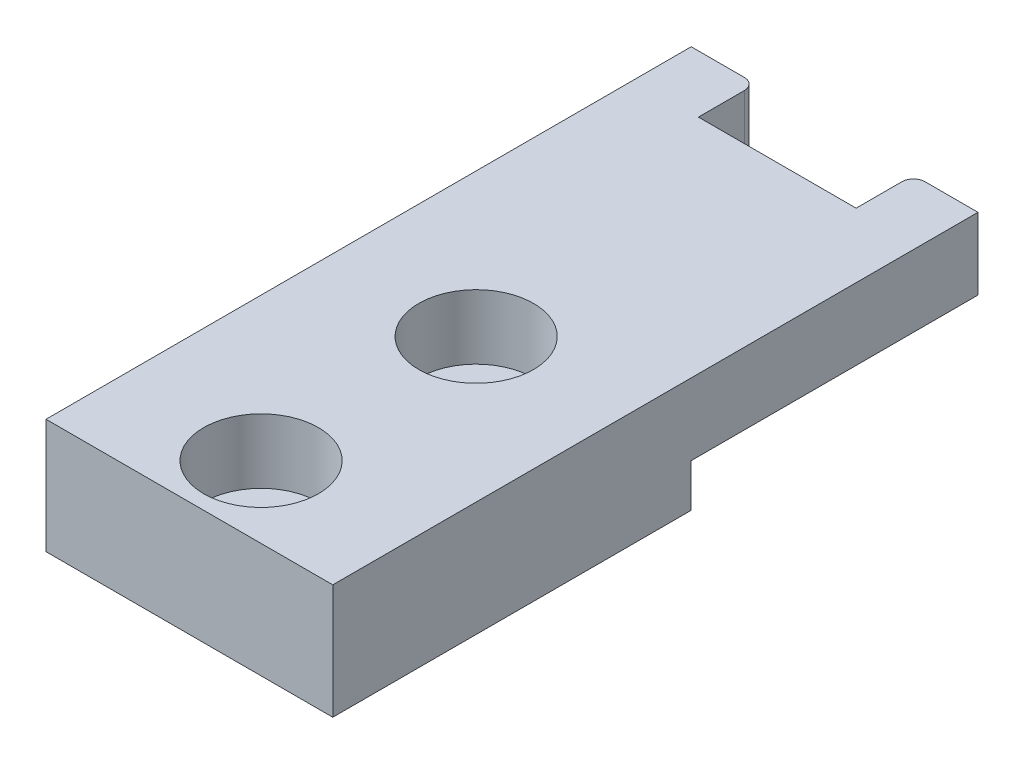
ISO-10303-21;
HEADER;
FILE_DESCRIPTION(('STEP AP214'),'2;1');
FILE_NAME('part.step','',(''),(''),'','','');
FILE_SCHEMA(('AUTOMOTIVE_DESIGN { 1 0 10303 214 1 1 1 1 }'));
ENDSEC;
DATA;
#1=APPLICATION_CONTEXT('core data for automotive mechanical design processes');
#2=APPLICATION_PROTOCOL_DEFINITION('international standard','automotive_design',2000,#1);
#3=PRODUCT_CONTEXT('',#1,'mechanical');
#4=PRODUCT('Part','Part','',(#3));
#5=PRODUCT_RELATED_PRODUCT_CATEGORY('part','',(#4));
#6=PRODUCT_DEFINITION_FORMATION('','',#4);
#7=PRODUCT_DEFINITION_CONTEXT('part definition',#1,'design');
#8=PRODUCT_DEFINITION('design','',#6,#7);
#9=PRODUCT_DEFINITION_SHAPE('','',#8);
#10=(LENGTH_UNIT() NAMED_UNIT(*) SI_UNIT(.MILLI.,.METRE.));
#11=(NAMED_UNIT(*) PLANE_ANGLE_UNIT() SI_UNIT($,.RADIAN.));
#12=(NAMED_UNIT(*) SI_UNIT($,.STERADIAN.) SOLID_ANGLE_UNIT());
#13=UNCERTAINTY_MEASURE_WITH_UNIT(LENGTH_MEASURE(1.E-05),#10,'distance_accuracy_value','');
#14=(GEOMETRIC_REPRESENTATION_CONTEXT(3) GLOBAL_UNCERTAINTY_ASSIGNED_CONTEXT((#13)) GLOBAL_UNIT_ASSIGNED_CONTEXT((#10,
#11,#12)) REPRESENTATION_CONTEXT('',''));
#15=CARTESIAN_POINT('',(0.,0.,0.));
#16=DIRECTION('',(0.,0.,1.));
#17=DIRECTION('',(1.,0.,0.));
#18=AXIS2_PLACEMENT_3D('',#15,#16,#17);
#19=CARTESIAN_POINT('',(10.,-37.,40.));
#20=DIRECTION('',(0.,1.,0.));
#21=DIRECTION('',(0.,0.,1.));
#22=AXIS2_PLACEMENT_3D('',#19,#20,#21);
#23=CYLINDRICAL_SURFACE('',#22,2.25);
#24=CARTESIAN_POINT('',(10.,0.,40.));
#25=DIRECTION('',(0.,1.,0.));
#26=DIRECTION('',(0.,0.,1.));
#27=AXIS2_PLACEMENT_3D('',#24,#25,#26);
#28=CIRCLE('',#27,2.25);
#29=CARTESIAN_POINT('',(10.,0.,42.25));
#30=VERTEX_POINT('',#29);
#31=EDGE_CURVE('E191',#30,#30,#28,.T.);
#32=CARTESIAN_POINT('',(10.,3.5,40.));
#33=DIRECTION('',(0.,1.,0.));
#34=DIRECTION('',(0.,0.,1.));
#35=AXIS2_PLACEMENT_3D('',#32,#33,#34);
#36=CIRCLE('',#35,2.25);
#37=CARTESIAN_POINT('',(10.,3.5,42.25));
#38=VERTEX_POINT('',#37);
#39=EDGE_CURVE('E149',#38,#38,#36,.F.);
#40=CARTESIAN_POINT('',(10.,0.,42.25));
#41=CARTESIAN_POINT('',(10.,0.0364583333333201,42.25));
#42=CARTESIAN_POINT('',(10.,0.072916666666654,42.25));
#43=CARTESIAN_POINT('',(10.,0.145833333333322,42.25));
#44=CARTESIAN_POINT('',(10.,0.182291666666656,42.25));
#45=CARTESIAN_POINT('',(10.,0.255208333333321,42.25));
#46=CARTESIAN_POINT('',(10.,0.291666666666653,42.25));
#47=CARTESIAN_POINT('',(10.,0.364583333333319,42.25));
#48=CARTESIAN_POINT('',(10.,0.401041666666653,42.25));
#49=CARTESIAN_POINT('',(10.,0.47395833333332,42.25));
#50=CARTESIAN_POINT('',(10.,0.510416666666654,42.25));
#51=CARTESIAN_POINT('',(10.,0.583333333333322,42.25));
#52=CARTESIAN_POINT('',(10.,0.619791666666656,42.25));
#53=CARTESIAN_POINT('',(10.,0.692708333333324,42.25));
#54=CARTESIAN_POINT('',(10.,0.729166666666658,42.25));
#55=CARTESIAN_POINT('',(10.,0.802083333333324,42.25));
#56=CARTESIAN_POINT('',(10.,0.838541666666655,42.25));
#57=CARTESIAN_POINT('',(10.,0.911458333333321,42.25));
#58=CARTESIAN_POINT('',(10.,0.947916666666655,42.25));
#59=CARTESIAN_POINT('',(10.,1.02083333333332,42.25));
#60=CARTESIAN_POINT('',(10.,1.05729166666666,42.25));
#61=CARTESIAN_POINT('',(10.,1.13020833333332,42.25));
#62=CARTESIAN_POINT('',(10.,1.16666666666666,42.25));
#63=CARTESIAN_POINT('',(10.,1.23958333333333,42.25));
#64=CARTESIAN_POINT('',(10.,1.27604166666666,42.25));
#65=CARTESIAN_POINT('',(10.,1.34895833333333,42.25));
#66=CARTESIAN_POINT('',(10.,1.38541666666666,42.25));
#67=CARTESIAN_POINT('',(10.,1.45833333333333,42.25));
#68=CARTESIAN_POINT('',(10.,1.49479166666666,42.25));
#69=CARTESIAN_POINT('',(10.,1.56770833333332,42.25));
#70=CARTESIAN_POINT('',(10.,1.60416666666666,42.25));
#71=CARTESIAN_POINT('',(10.,1.67708333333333,42.25));
#72=CARTESIAN_POINT('',(10.,1.71354166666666,42.25));
#73=CARTESIAN_POINT('',(10.,1.78645833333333,42.25));
#74=CARTESIAN_POINT('',(10.,1.82291666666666,42.25));
#75=CARTESIAN_POINT('',(10.,1.89583333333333,42.25));
#76=CARTESIAN_POINT('',(10.,1.93229166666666,42.25));
#77=CARTESIAN_POINT('',(10.,2.00520833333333,42.25));
#78=CARTESIAN_POINT('',(10.,2.04166666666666,42.25));
#79=CARTESIAN_POINT('',(10.,2.11458333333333,42.25));
#80=CARTESIAN_POINT('',(10.,2.15104166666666,42.25));
#81=CARTESIAN_POINT('',(10.,2.22395833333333,42.25));
#82=CARTESIAN_POINT('',(10.,2.26041666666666,42.25));
#83=CARTESIAN_POINT('',(10.,2.33333333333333,42.25));
#84=CARTESIAN_POINT('',(10.,2.36979166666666,42.25));
#85=CARTESIAN_POINT('',(10.,2.44270833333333,42.25));
#86=CARTESIAN_POINT('',(10.,2.47916666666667,42.25));
#87=CARTESIAN_POINT('',(10.,2.55208333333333,42.25));
#88=CARTESIAN_POINT('',(10.,2.58854166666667,42.25));
#89=CARTESIAN_POINT('',(10.,2.66145833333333,42.25));
#90=CARTESIAN_POINT('',(10.,2.69791666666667,42.25));
#91=CARTESIAN_POINT('',(10.,2.77083333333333,42.25));
#92=CARTESIAN_POINT('',(10.,2.80729166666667,42.25));
#93=CARTESIAN_POINT('',(10.,2.88020833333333,42.25));
#94=CARTESIAN_POINT('',(10.,2.91666666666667,42.25));
#95=CARTESIAN_POINT('',(10.,2.98958333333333,42.25));
#96=CARTESIAN_POINT('',(10.,3.02604166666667,42.25));
#97=CARTESIAN_POINT('',(10.,3.09895833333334,42.25));
#98=CARTESIAN_POINT('',(10.,3.13541666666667,42.25));
#99=CARTESIAN_POINT('',(10.,3.20833333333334,42.25));
#100=CARTESIAN_POINT('',(10.,3.24479166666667,42.25));
#101=CARTESIAN_POINT('',(10.,3.31770833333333,42.25));
#102=CARTESIAN_POINT('',(10.,3.35416666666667,42.25));
#103=CARTESIAN_POINT('',(10.,3.42708333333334,42.25));
#104=CARTESIAN_POINT('',(10.,3.46354166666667,42.25));
#105=CARTESIAN_POINT('',(10.,3.5,42.25));
#106=B_SPLINE_CURVE_WITH_KNOTS('',3,(#40,#41,#42,#43,#44,#45,#46,#47,#48,#49,#50,#51,#52,#53,
#54,#55,#56,#57,#58,#59,#60,#61,#62,#63,#64,#65,#66,#67,#68,#69,#70,#71,#72,#73,#74,#75,#76,#77,
#78,#79,#80,#81,#82,#83,#84,#85,#86,#87,#88,#89,#90,#91,#92,#93,#94,#95,#96,#97,#98,#99,#100,
#101,#102,#103,#104,#105),.UNSPECIFIED.,.F.,.F.,(4,2,2,2,2,2,2,2,2,2,2,2,2,2,2,2,2,2,2,2,2,2,2,
2,2,2,2,2,2,2,2,2,4),(0.,0.109375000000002,0.218750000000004,0.328124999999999,0.4375,
0.546875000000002,0.656250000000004,0.765625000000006,0.875000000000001,0.984375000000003,
1.09375,1.20312500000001,1.31250000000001,1.42187500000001,1.53125,1.64062500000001,
1.75000000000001,1.85937500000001,1.96875000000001,2.07812500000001,2.18750000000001,
2.29687500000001,2.40625000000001,2.51562500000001,2.62500000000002,2.73437500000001,
2.84375000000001,2.95312500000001,3.06250000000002,3.17187500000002,3.28125000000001,
3.39062500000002,3.50000000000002),.UNSPECIFIED.);
#107=EDGE_CURVE('BSEAM33',#30,#38,#106,.T.);
#108=ORIENTED_EDGE('',*,*,#31,.F.);
#109=ORIENTED_EDGE('',*,*,#39,.F.);
#110=ORIENTED_EDGE('',*,*,#107,.T.);
#111=ORIENTED_EDGE('',*,*,#107,.F.);
#112=EDGE_LOOP('',(#108,#110,#109,#111));
#113=FACE_BOUND('',#112,.T.);
#114=ADVANCED_FACE('F33',(#113),#23,.F.);
#115=CARTESIAN_POINT('',(10.,-37.,25.));
#116=DIRECTION('',(0.,1.,0.));
#117=DIRECTION('',(0.,0.,1.));
#118=AXIS2_PLACEMENT_3D('',#115,#116,#117);
#119=CYLINDRICAL_SURFACE('',#118,2.25);
#120=CARTESIAN_POINT('',(10.,0.,25.));
#121=DIRECTION('',(0.,1.,0.));
#122=DIRECTION('',(0.,0.,1.));
#123=AXIS2_PLACEMENT_3D('',#120,#121,#122);
#124=CIRCLE('',#123,2.25);
#125=CARTESIAN_POINT('',(10.,0.,27.25));
#126=VERTEX_POINT('',#125);
#127=EDGE_CURVE('E181',#126,#126,#124,.T.);
#128=CARTESIAN_POINT('',(10.,3.5,25.));
#129=DIRECTION('',(0.,1.,0.));
#130=DIRECTION('',(0.,0.,1.));
#131=AXIS2_PLACEMENT_3D('',#128,#129,#130);
#132=CIRCLE('',#131,2.25);
#133=CARTESIAN_POINT('',(10.,3.5,27.25));
#134=VERTEX_POINT('',#133);
#135=EDGE_CURVE('E154',#134,#134,#132,.F.);
#136=CARTESIAN_POINT('',(10.,0.,27.25));
#137=CARTESIAN_POINT('',(10.,0.0364583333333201,27.25));
#138=CARTESIAN_POINT('',(10.,0.072916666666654,27.25));
#139=CARTESIAN_POINT('',(10.,0.145833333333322,27.25));
#140=CARTESIAN_POINT('',(10.,0.182291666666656,27.25));
#141=CARTESIAN_POINT('',(10.,0.255208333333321,27.25));
#142=CARTESIAN_POINT('',(10.,0.291666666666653,27.25));
#143=CARTESIAN_POINT('',(10.,0.364583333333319,27.25));
#144=CARTESIAN_POINT('',(10.,0.401041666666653,27.25));
#145=CARTESIAN_POINT('',(10.,0.47395833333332,27.25));
#146=CARTESIAN_POINT('',(10.,0.510416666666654,27.25));
#147=CARTESIAN_POINT('',(10.,0.583333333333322,27.25));
#148=CARTESIAN_POINT('',(10.,0.619791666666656,27.25));
#149=CARTESIAN_POINT('',(10.,0.692708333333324,27.25));
#150=CARTESIAN_POINT('',(10.,0.729166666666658,27.25));
#151=CARTESIAN_POINT('',(10.,0.802083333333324,27.25));
#152=CARTESIAN_POINT('',(10.,0.838541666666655,27.25));
#153=CARTESIAN_POINT('',(10.,0.911458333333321,27.25));
#154=CARTESIAN_POINT('',(10.,0.947916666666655,27.25));
#155=CARTESIAN_POINT('',(10.,1.02083333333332,27.25));
#156=CARTESIAN_POINT('',(10.,1.05729166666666,27.25));
#157=CARTESIAN_POINT('',(10.,1.13020833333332,27.25));
#158=CARTESIAN_POINT('',(10.,1.16666666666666,27.25));
#159=CARTESIAN_POINT('',(10.,1.23958333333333,27.25));
#160=CARTESIAN_POINT('',(10.,1.27604166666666,27.25));
#161=CARTESIAN_POINT('',(10.,1.34895833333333,27.25));
#162=CARTESIAN_POINT('',(10.,1.38541666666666,27.25));
#163=CARTESIAN_POINT('',(10.,1.45833333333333,27.25));
#164=CARTESIAN_POINT('',(10.,1.49479166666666,27.25));
#165=CARTESIAN_POINT('',(10.,1.56770833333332,27.25));
#166=CARTESIAN_POINT('',(10.,1.60416666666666,27.25));
#167=CARTESIAN_POINT('',(10.,1.67708333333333,27.25));
#168=CARTESIAN_POINT('',(10.,1.71354166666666,27.25));
#169=CARTESIAN_POINT('',(10.,1.78645833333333,27.25));
#170=CARTESIAN_POINT('',(10.,1.82291666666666,27.25));
#171=CARTESIAN_POINT('',(10.,1.89583333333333,27.25));
#172=CARTESIAN_POINT('',(10.,1.93229166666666,27.25));
#173=CARTESIAN_POINT('',(10.,2.00520833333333,27.25));
#174=CARTESIAN_POINT('',(10.,2.04166666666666,27.25));
#175=CARTESIAN_POINT('',(10.,2.11458333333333,27.25));
#176=CARTESIAN_POINT('',(10.,2.15104166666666,27.25));
#177=CARTESIAN_POINT('',(10.,2.22395833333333,27.25));
#178=CARTESIAN_POINT('',(10.,2.26041666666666,27.25));
#179=CARTESIAN_POINT('',(10.,2.33333333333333,27.25));
#180=CARTESIAN_POINT('',(10.,2.36979166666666,27.25));
#181=CARTESIAN_POINT('',(10.,2.44270833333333,27.25));
#182=CARTESIAN_POINT('',(10.,2.47916666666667,27.25));
#183=CARTESIAN_POINT('',(10.,2.55208333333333,27.25));
#184=CARTESIAN_POINT('',(10.,2.58854166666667,27.25));
#185=CARTESIAN_POINT('',(10.,2.66145833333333,27.25));
#186=CARTESIAN_POINT('',(10.,2.69791666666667,27.25));
#187=CARTESIAN_POINT('',(10.,2.77083333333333,27.25));
#188=CARTESIAN_POINT('',(10.,2.80729166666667,27.25));
#189=CARTESIAN_POINT('',(10.,2.88020833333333,27.25));
#190=CARTESIAN_POINT('',(10.,2.91666666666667,27.25));
#191=CARTESIAN_POINT('',(10.,2.98958333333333,27.25));
#192=CARTESIAN_POINT('',(10.,3.02604166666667,27.25));
#193=CARTESIAN_POINT('',(10.,3.09895833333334,27.25));
#194=CARTESIAN_POINT('',(10.,3.13541666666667,27.25));
#195=CARTESIAN_POINT('',(10.,3.20833333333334,27.25));
#196=CARTESIAN_POINT('',(10.,3.24479166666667,27.25));
#197=CARTESIAN_POINT('',(10.,3.31770833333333,27.25));
#198=CARTESIAN_POINT('',(10.,3.35416666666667,27.25));
#199=CARTESIAN_POINT('',(10.,3.42708333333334,27.25));
#200=CARTESIAN_POINT('',(10.,3.46354166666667,27.25));
#201=CARTESIAN_POINT('',(10.,3.5,27.25));
#202=B_SPLINE_CURVE_WITH_KNOTS('',3,(#136,#137,#138,#139,#140,#141,#142,#143,#144,#145,#146,
#147,#148,#149,#150,#151,#152,#153,#154,#155,#156,#157,#158,#159,#160,#161,#162,#163,#164,#165,
#166,#167,#168,#169,#170,#171,#172,#173,#174,#175,#176,#177,#178,#179,#180,#181,#182,#183,#184,
#185,#186,#187,#188,#189,#190,#191,#192,#193,#194,#195,#196,#197,#198,#199,#200,#201),
.UNSPECIFIED.,.F.,.F.,(4,2,2,2,2,2,2,2,2,2,2,2,2,2,2,2,2,2,2,2,2,2,2,2,2,2,2,2,2,2,2,2,4),(0.,
0.109375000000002,0.218750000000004,0.328124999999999,0.4375,0.546875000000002,
0.656250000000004,0.765625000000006,0.875000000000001,0.984375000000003,1.09375,
1.20312500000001,1.31250000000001,1.42187500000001,1.53125,1.64062500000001,1.75000000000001,
1.85937500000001,1.96875000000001,2.07812500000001,2.18750000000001,2.29687500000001,
2.40625000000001,2.51562500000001,2.62500000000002,2.73437500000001,2.84375000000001,
2.95312500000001,3.06250000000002,3.17187500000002,3.28125000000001,3.39062500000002,
3.50000000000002),.UNSPECIFIED.);
#203=EDGE_CURVE('BSEAM265',#126,#134,#202,.T.);
#204=ORIENTED_EDGE('',*,*,#127,.F.);
#205=ORIENTED_EDGE('',*,*,#135,.F.);
#206=ORIENTED_EDGE('',*,*,#203,.T.);
#207=ORIENTED_EDGE('',*,*,#203,.F.);
#208=EDGE_LOOP('',(#204,#206,#205,#207));
#209=FACE_BOUND('',#208,.T.);
#210=ADVANCED_FACE('F265',(#209),#119,.F.);
#211=CARTESIAN_POINT('',(0.,0.,45.));
#212=DIRECTION('',(0.,1.,0.));
#213=DIRECTION('',(0.,0.,1.));
#214=AXIS2_PLACEMENT_3D('',#211,#212,#213);
#215=PLANE('',#214);
#216=ORIENTED_EDGE('',*,*,#127,.T.);
#217=EDGE_LOOP('',(#216));
#218=FACE_BOUND('',#217,.T.);
#219=ORIENTED_EDGE('',*,*,#31,.T.);
#220=EDGE_LOOP('',(#219));
#221=FACE_BOUND('',#220,.T.);
#222=DIRECTION('',(0.,0.,-1.));
#223=VECTOR('',#222,1.);
#224=CARTESIAN_POINT('',(0.,0.,45.));
#225=LINE('',#224,#223);
#226=CARTESIAN_POINT('',(0.,0.,45.));
#227=VERTEX_POINT('',#226);
#228=CARTESIAN_POINT('',(0.,0.,19.9999999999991));
#229=VERTEX_POINT('',#228);
#230=EDGE_CURVE('E160',#227,#229,#225,.T.);
#231=ORIENTED_EDGE('',*,*,#230,.T.);
#232=DIRECTION('',(-1.,0.,0.));
#233=VECTOR('',#232,1.);
#234=CARTESIAN_POINT('',(94.8623484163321,-2.27373675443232E-13,19.9999999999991));
#235=LINE('',#234,#233);
#236=CARTESIAN_POINT('',(20.,0.,19.9999999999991));
#237=VERTEX_POINT('',#236);
#238=EDGE_CURVE('E232',#237,#229,#235,.T.);
#239=ORIENTED_EDGE('',*,*,#238,.F.);
#240=DIRECTION('',(0.,0.,-1.));
#241=VECTOR('',#240,1.);
#242=CARTESIAN_POINT('',(20.,0.,45.));
#243=LINE('',#242,#241);
#244=CARTESIAN_POINT('',(20.,0.,45.));
#245=VERTEX_POINT('',#244);
#246=EDGE_CURVE('E162',#245,#237,#243,.T.);
#247=ORIENTED_EDGE('',*,*,#246,.F.);
#248=DIRECTION('',(1.,0.,0.));
#249=VECTOR('',#248,1.);
#250=CARTESIAN_POINT('',(0.,0.,45.));
#251=LINE('',#250,#249);
#252=EDGE_CURVE('E185',#227,#245,#251,.T.);
#253=ORIENTED_EDGE('',*,*,#252,.F.);
#254=EDGE_LOOP('',(#231,#239,#247,#253));
#255=FACE_BOUND('',#254,.T.);
#256=ADVANCED_FACE('F241',(#218,#221,#255),#215,.F.);
#257=CARTESIAN_POINT('',(0.,8.,45.));
#258=DIRECTION('',(0.,-1.,0.));
#259=DIRECTION('',(0.,0.,-1.));
#260=AXIS2_PLACEMENT_3D('',#257,#258,#259);
#261=PLANE('',#260);
#262=CARTESIAN_POINT('',(10.,8.,40.));
#263=DIRECTION('',(0.,1.,0.));
#264=DIRECTION('',(0.,0.,1.));
#265=AXIS2_PLACEMENT_3D('',#262,#263,#264);
#266=CIRCLE('',#265,4.);
#267=CARTESIAN_POINT('',(10.,8.,44.));
#268=VERTEX_POINT('',#267);
#269=EDGE_CURVE('E213',#268,#268,#266,.T.);
#270=ORIENTED_EDGE('',*,*,#269,.F.);
#271=EDGE_LOOP('',(#270));
#272=FACE_BOUND('',#271,.T.);
#273=CARTESIAN_POINT('',(10.,8.,25.));
#274=DIRECTION('',(0.,1.,0.));
#275=DIRECTION('',(0.,0.,1.));
#276=AXIS2_PLACEMENT_3D('',#273,#274,#275);
#277=CIRCLE('',#276,4.);
#278=CARTESIAN_POINT('',(10.,8.,29.));
#279=VERTEX_POINT('',#278);
#280=EDGE_CURVE('E152',#279,#279,#277,.T.);
#281=ORIENTED_EDGE('',*,*,#280,.F.);
#282=EDGE_LOOP('',(#281));
#283=FACE_BOUND('',#282,.T.);
#284=CARTESIAN_POINT('',(16.2999999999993,8.,0.800000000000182));
#285=DIRECTION('',(0.,1.,0.));
#286=DIRECTION('',(0.,0.,1.));
#287=AXIS2_PLACEMENT_3D('',#284,#285,#286);
#288=CIRCLE('',#287,0.799999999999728);
#289=CARTESIAN_POINT('',(16.2999999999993,8.,0.));
#290=VERTEX_POINT('',#289);
#291=CARTESIAN_POINT('',(15.4999999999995,8.,0.800000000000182));
#292=VERTEX_POINT('',#291);
#293=EDGE_CURVE('E201',#290,#292,#288,.T.);
#294=ORIENTED_EDGE('',*,*,#293,.T.);
#295=DIRECTION('',(0.,0.,1.));
#296=VECTOR('',#295,1.);
#297=CARTESIAN_POINT('',(15.5,8.,4.));
#298=LINE('',#297,#296);
#299=CARTESIAN_POINT('',(15.5,8.,4.));
#300=VERTEX_POINT('',#299);
#301=EDGE_CURVE('E195',#292,#300,#298,.T.);
#302=ORIENTED_EDGE('',*,*,#301,.T.);
#303=DIRECTION('',(-1.,0.,0.));
#304=VECTOR('',#303,1.);
#305=CARTESIAN_POINT('',(4.5,8.,4.));
#306=LINE('',#305,#304);
#307=CARTESIAN_POINT('',(4.5,8.,4.));
#308=VERTEX_POINT('',#307);
#309=EDGE_CURVE('E156',#300,#308,#306,.T.);
#310=ORIENTED_EDGE('',*,*,#309,.T.);
#311=DIRECTION('',(0.,0.,-1.));
#312=VECTOR('',#311,1.);
#313=CARTESIAN_POINT('',(4.5,8.,4.));
#314=LINE('',#313,#312);
#315=CARTESIAN_POINT('',(4.5,8.,0.800000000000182));
#316=VERTEX_POINT('',#315);
#317=EDGE_CURVE('E205',#308,#316,#314,.T.);
#318=ORIENTED_EDGE('',*,*,#317,.T.);
#319=CARTESIAN_POINT('',(3.70000000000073,8.,0.800000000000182));
#320=DIRECTION('',(0.,1.,0.));
#321=DIRECTION('',(0.,0.,1.));
#322=AXIS2_PLACEMENT_3D('',#319,#320,#321);
#323=CIRCLE('',#322,0.799999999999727);
#324=CARTESIAN_POINT('',(3.70000000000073,8.,4.54605970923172E-13));
#325=VERTEX_POINT('',#324);
#326=EDGE_CURVE('E126',#316,#325,#323,.T.);
#327=ORIENTED_EDGE('',*,*,#326,.T.);
#328=DIRECTION('',(-1.,0.,0.));
#329=VECTOR('',#328,1.);
#330=CARTESIAN_POINT('',(0.,8.,0.));
#331=LINE('',#330,#329);
#332=CARTESIAN_POINT('',(0.,8.,0.));
#333=VERTEX_POINT('',#332);
#334=EDGE_CURVE('E176',#325,#333,#331,.T.);
#335=ORIENTED_EDGE('',*,*,#334,.T.);
#336=DIRECTION('',(0.,0.,-1.));
#337=VECTOR('',#336,1.);
#338=CARTESIAN_POINT('',(0.,8.,45.));
#339=LINE('',#338,#337);
#340=CARTESIAN_POINT('',(0.,8.,45.));
#341=VERTEX_POINT('',#340);
#342=EDGE_CURVE('E168',#341,#333,#339,.T.);
#343=ORIENTED_EDGE('',*,*,#342,.F.);
#344=DIRECTION('',(-1.,0.,0.));
#345=VECTOR('',#344,1.);
#346=CARTESIAN_POINT('',(0.,8.,45.));
#347=LINE('',#346,#345);
#348=CARTESIAN_POINT('',(20.,8.,45.));
#349=VERTEX_POINT('',#348);
#350=EDGE_CURVE('E171',#349,#341,#347,.T.);
#351=ORIENTED_EDGE('',*,*,#350,.F.);
#352=DIRECTION('',(0.,0.,-1.));
#353=VECTOR('',#352,1.);
#354=CARTESIAN_POINT('',(20.,8.,45.));
#355=LINE('',#354,#353);
#356=CARTESIAN_POINT('',(20.,8.,0.));
#357=VERTEX_POINT('',#356);
#358=EDGE_CURVE('E165',#349,#357,#355,.T.);
#359=ORIENTED_EDGE('',*,*,#358,.T.);
#360=EDGE_CURVE('E172',#357,#290,#331,.T.);
#361=ORIENTED_EDGE('',*,*,#360,.T.);
#362=EDGE_LOOP('',(#294,#302,#310,#318,#327,#335,#343,#351,#359,#361));
#363=FACE_BOUND('',#362,.T.);
#364=ADVANCED_FACE('F260',(#272,#283,#363),#261,.F.);
#365=CARTESIAN_POINT('',(0.,8.,0.));
#366=DIRECTION('',(0.,0.,-1.));
#367=DIRECTION('',(-1.,0.,0.));
#368=AXIS2_PLACEMENT_3D('',#365,#366,#367);
#369=PLANE('',#368);
#370=DIRECTION('',(-1.,0.,0.));
#371=VECTOR('',#370,1.);
#372=CARTESIAN_POINT('',(94.8623484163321,2.99999999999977,-9.09494701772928E-13));
#373=LINE('',#372,#371);
#374=CARTESIAN_POINT('',(20.,2.99999999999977,0.));
#375=VERTEX_POINT('',#374);
#376=CARTESIAN_POINT('',(16.2999999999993,2.99999999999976,2.27140355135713E-13));
#377=VERTEX_POINT('',#376);
#378=EDGE_CURVE('E140',#375,#377,#373,.T.);
#379=ORIENTED_EDGE('',*,*,#378,.T.);
#380=DIRECTION('',(0.,1.,0.));
#381=VECTOR('',#380,1.);
#382=CARTESIAN_POINT('',(16.2999999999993,-37.,2.27140355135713E-13));
#383=LINE('',#382,#381);
#384=EDGE_CURVE('E145',#377,#290,#383,.T.);
#385=ORIENTED_EDGE('',*,*,#384,.T.);
#386=ORIENTED_EDGE('',*,*,#360,.F.);
#387=DIRECTION('',(0.,1.,0.));
#388=VECTOR('',#387,1.);
#389=CARTESIAN_POINT('',(20.,0.,0.));
#390=LINE('',#389,#388);
#391=EDGE_CURVE('E177',#375,#357,#390,.T.);
#392=ORIENTED_EDGE('',*,*,#391,.F.);
#393=EDGE_LOOP('',(#379,#385,#386,#392));
#394=FACE_BOUND('',#393,.T.);
#395=ADVANCED_FACE('F254',(#394),#369,.T.);
#396=CARTESIAN_POINT('',(0.,0.,45.));
#397=DIRECTION('',(1.,0.,0.));
#398=DIRECTION('',(0.,0.,-1.));
#399=AXIS2_PLACEMENT_3D('',#396,#397,#398);
#400=PLANE('',#399);
#401=DIRECTION('',(0.,-1.,0.));
#402=VECTOR('',#401,1.);
#403=CARTESIAN_POINT('',(0.,0.,0.));
#404=LINE('',#403,#402);
#405=CARTESIAN_POINT('',(0.,2.99999999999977,0.));
#406=VERTEX_POINT('',#405);
#407=EDGE_CURVE('E179',#333,#406,#404,.T.);
#408=ORIENTED_EDGE('',*,*,#407,.T.);
#409=DIRECTION('',(0.,0.,1.));
#410=VECTOR('',#409,1.);
#411=CARTESIAN_POINT('',(0.,2.99999999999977,45.));
#412=LINE('',#411,#410);
#413=CARTESIAN_POINT('',(0.,2.99999999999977,19.9999999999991));
#414=VERTEX_POINT('',#413);
#415=EDGE_CURVE('E48',#406,#414,#412,.T.);
#416=ORIENTED_EDGE('',*,*,#415,.T.);
#417=DIRECTION('',(0.,-1.,0.));
#418=VECTOR('',#417,1.);
#419=CARTESIAN_POINT('',(0.,0.,19.9999999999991));
#420=LINE('',#419,#418);
#421=EDGE_CURVE('E52',#414,#229,#420,.T.);
#422=ORIENTED_EDGE('',*,*,#421,.T.);
#423=ORIENTED_EDGE('',*,*,#230,.F.);
#424=DIRECTION('',(0.,-1.,0.));
#425=VECTOR('',#424,1.);
#426=CARTESIAN_POINT('',(0.,0.,45.));
#427=LINE('',#426,#425);
#428=EDGE_CURVE('E175',#341,#227,#427,.T.);
#429=ORIENTED_EDGE('',*,*,#428,.F.);
#430=ORIENTED_EDGE('',*,*,#342,.T.);
#431=EDGE_LOOP('',(#408,#416,#422,#423,#429,#430));
#432=FACE_BOUND('',#431,.T.);
#433=ADVANCED_FACE('F35',(#432),#400,.F.);
#434=CARTESIAN_POINT('',(20.,0.,45.));
#435=DIRECTION('',(-1.,0.,0.));
#436=DIRECTION('',(0.,0.,1.));
#437=AXIS2_PLACEMENT_3D('',#434,#435,#436);
#438=PLANE('',#437);
#439=DIRECTION('',(0.,1.,0.));
#440=VECTOR('',#439,1.);
#441=CARTESIAN_POINT('',(20.,0.,19.9999999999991));
#442=LINE('',#441,#440);
#443=CARTESIAN_POINT('',(20.,2.99999999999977,19.9999999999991));
#444=VERTEX_POINT('',#443);
#445=EDGE_CURVE('E12',#237,#444,#442,.T.);
#446=ORIENTED_EDGE('',*,*,#445,.T.);
#447=DIRECTION('',(0.,0.,-1.));
#448=VECTOR('',#447,1.);
#449=CARTESIAN_POINT('',(20.,2.99999999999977,45.));
#450=LINE('',#449,#448);
#451=EDGE_CURVE('E220',#444,#375,#450,.T.);
#452=ORIENTED_EDGE('',*,*,#451,.T.);
#453=ORIENTED_EDGE('',*,*,#391,.T.);
#454=ORIENTED_EDGE('',*,*,#358,.F.);
#455=DIRECTION('',(0.,1.,0.));
#456=VECTOR('',#455,1.);
#457=CARTESIAN_POINT('',(20.,0.,45.));
#458=LINE('',#457,#456);
#459=EDGE_CURVE('E183',#245,#349,#458,.T.);
#460=ORIENTED_EDGE('',*,*,#459,.F.);
#461=ORIENTED_EDGE('',*,*,#246,.T.);
#462=EDGE_LOOP('',(#446,#452,#453,#454,#460,#461));
#463=FACE_BOUND('',#462,.T.);
#464=ADVANCED_FACE('F244',(#463),#438,.F.);
#465=CARTESIAN_POINT('',(0.,8.,45.));
#466=DIRECTION('',(0.,0.,-1.));
#467=DIRECTION('',(-1.,0.,0.));
#468=AXIS2_PLACEMENT_3D('',#465,#466,#467);
#469=PLANE('',#468);
#470=ORIENTED_EDGE('',*,*,#428,.T.);
#471=ORIENTED_EDGE('',*,*,#252,.T.);
#472=ORIENTED_EDGE('',*,*,#459,.T.);
#473=ORIENTED_EDGE('',*,*,#350,.T.);
#474=EDGE_LOOP('',(#470,#471,#472,#473));
#475=FACE_BOUND('',#474,.T.);
#476=ADVANCED_FACE('F249',(#475),#469,.F.);
#477=CARTESIAN_POINT('',(3.70000000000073,2.99999999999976,2.2735719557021E-13));
#478=VERTEX_POINT('',#477);
#479=EDGE_CURVE('E144',#478,#406,#373,.T.);
#480=ORIENTED_EDGE('',*,*,#479,.T.);
#481=ORIENTED_EDGE('',*,*,#407,.F.);
#482=ORIENTED_EDGE('',*,*,#334,.F.);
#483=DIRECTION('',(0.,1.,0.));
#484=VECTOR('',#483,1.);
#485=CARTESIAN_POINT('',(3.70000000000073,-37.,2.2735719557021E-13));
#486=LINE('',#485,#484);
#487=EDGE_CURVE('E146',#478,#325,#486,.T.);
#488=ORIENTED_EDGE('',*,*,#487,.F.);
#489=EDGE_LOOP('',(#480,#481,#482,#488));
#490=FACE_BOUND('',#489,.T.);
#491=ADVANCED_FACE('F263',(#490),#369,.T.);
#492=CARTESIAN_POINT('',(4.5,-37.,4.));
#493=DIRECTION('',(0.,0.,-1.));
#494=DIRECTION('',(-1.,0.,0.));
#495=AXIS2_PLACEMENT_3D('',#492,#493,#494);
#496=PLANE('',#495);
#497=DIRECTION('',(1.,0.,0.));
#498=VECTOR('',#497,1.);
#499=CARTESIAN_POINT('',(4.5,2.99999999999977,4.));
#500=LINE('',#499,#498);
#501=CARTESIAN_POINT('',(4.5,2.99999999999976,4.));
#502=VERTEX_POINT('',#501);
#503=CARTESIAN_POINT('',(15.5,2.99999999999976,4.));
#504=VERTEX_POINT('',#503);
#505=EDGE_CURVE('E139',#502,#504,#500,.T.);
#506=ORIENTED_EDGE('',*,*,#505,.F.);
#507=DIRECTION('',(0.,1.,0.));
#508=VECTOR('',#507,1.);
#509=CARTESIAN_POINT('',(4.5,-37.,4.));
#510=LINE('',#509,#508);
#511=EDGE_CURVE('E131',#502,#308,#510,.T.);
#512=ORIENTED_EDGE('',*,*,#511,.T.);
#513=ORIENTED_EDGE('',*,*,#309,.F.);
#514=DIRECTION('',(0.,1.,0.));
#515=VECTOR('',#514,1.);
#516=CARTESIAN_POINT('',(15.5,-37.,4.));
#517=LINE('',#516,#515);
#518=EDGE_CURVE('E194',#504,#300,#517,.T.);
#519=ORIENTED_EDGE('',*,*,#518,.F.);
#520=EDGE_LOOP('',(#506,#512,#513,#519));
#521=FACE_BOUND('',#520,.T.);
#522=ADVANCED_FACE('F276',(#521),#496,.T.);
#523=CARTESIAN_POINT('',(15.5,-37.,4.));
#524=DIRECTION('',(-1.,0.,0.));
#525=DIRECTION('',(0.,0.,1.));
#526=AXIS2_PLACEMENT_3D('',#523,#524,#525);
#527=PLANE('',#526);
#528=DIRECTION('',(0.,0.,-1.));
#529=VECTOR('',#528,1.);
#530=CARTESIAN_POINT('',(15.5,2.99999999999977,4.));
#531=LINE('',#530,#529);
#532=CARTESIAN_POINT('',(15.4999999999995,2.99999999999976,0.800000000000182));
#533=VERTEX_POINT('',#532);
#534=EDGE_CURVE('E225',#504,#533,#531,.T.);
#535=ORIENTED_EDGE('',*,*,#534,.F.);
#536=ORIENTED_EDGE('',*,*,#518,.T.);
#537=ORIENTED_EDGE('',*,*,#301,.F.);
#538=DIRECTION('',(0.,1.,0.));
#539=VECTOR('',#538,1.);
#540=CARTESIAN_POINT('',(15.4999999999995,-37.,0.800000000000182));
#541=LINE('',#540,#539);
#542=EDGE_CURVE('E130',#533,#292,#541,.T.);
#543=ORIENTED_EDGE('',*,*,#542,.F.);
#544=EDGE_LOOP('',(#535,#536,#537,#543));
#545=FACE_BOUND('',#544,.T.);
#546=ADVANCED_FACE('F312',(#545),#527,.T.);
#547=CARTESIAN_POINT('',(4.5,-37.,4.));
#548=DIRECTION('',(1.,0.,0.));
#549=DIRECTION('',(0.,0.,-1.));
#550=AXIS2_PLACEMENT_3D('',#547,#548,#549);
#551=PLANE('',#550);
#552=DIRECTION('',(0.,0.,1.));
#553=VECTOR('',#552,1.);
#554=CARTESIAN_POINT('',(4.5,2.99999999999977,4.));
#555=LINE('',#554,#553);
#556=CARTESIAN_POINT('',(4.50000000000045,2.99999999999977,0.800000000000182));
#557=VERTEX_POINT('',#556);
#558=EDGE_CURVE('E135',#557,#502,#555,.T.);
#559=ORIENTED_EDGE('',*,*,#558,.F.);
#560=DIRECTION('',(0.,1.,0.));
#561=VECTOR('',#560,1.);
#562=CARTESIAN_POINT('',(4.5,-37.,0.800000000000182));
#563=LINE('',#562,#561);
#564=EDGE_CURVE('E120',#557,#316,#563,.T.);
#565=ORIENTED_EDGE('',*,*,#564,.T.);
#566=ORIENTED_EDGE('',*,*,#317,.F.);
#567=ORIENTED_EDGE('',*,*,#511,.F.);
#568=EDGE_LOOP('',(#559,#565,#566,#567));
#569=FACE_BOUND('',#568,.T.);
#570=ADVANCED_FACE('F136',(#569),#551,.T.);
#571=CARTESIAN_POINT('',(16.2999999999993,-37.,0.800000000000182));
#572=DIRECTION('',(0.,1.,0.));
#573=DIRECTION('',(0.,0.,1.));
#574=AXIS2_PLACEMENT_3D('',#571,#572,#573);
#575=CYLINDRICAL_SURFACE('',#574,0.799999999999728);
#576=CARTESIAN_POINT('',(16.2999999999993,2.99999999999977,0.800000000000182));
#577=DIRECTION('',(0.,1.,0.));
#578=DIRECTION('',(0.,0.,1.));
#579=AXIS2_PLACEMENT_3D('',#576,#577,#578);
#580=CIRCLE('',#579,0.799999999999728);
#581=EDGE_CURVE('E222',#533,#377,#580,.F.);
#582=ORIENTED_EDGE('',*,*,#581,.F.);
#583=ORIENTED_EDGE('',*,*,#542,.T.);
#584=ORIENTED_EDGE('',*,*,#293,.F.);
#585=ORIENTED_EDGE('',*,*,#384,.F.);
#586=EDGE_LOOP('',(#582,#583,#584,#585));
#587=FACE_BOUND('',#586,.T.);
#588=ADVANCED_FACE('F306',(#587),#575,.T.);
#589=CARTESIAN_POINT('',(3.70000000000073,-37.,0.800000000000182));
#590=DIRECTION('',(0.,1.,0.));
#591=DIRECTION('',(0.,0.,1.));
#592=AXIS2_PLACEMENT_3D('',#589,#590,#591);
#593=CYLINDRICAL_SURFACE('',#592,0.799999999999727);
#594=CARTESIAN_POINT('',(3.70000000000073,2.99999999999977,0.800000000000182));
#595=DIRECTION('',(0.,1.,0.));
#596=DIRECTION('',(0.,0.,1.));
#597=AXIS2_PLACEMENT_3D('',#594,#595,#596);
#598=CIRCLE('',#597,0.799999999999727);
#599=EDGE_CURVE('E41',#478,#557,#598,.F.);
#600=ORIENTED_EDGE('',*,*,#599,.F.);
#601=ORIENTED_EDGE('',*,*,#487,.T.);
#602=ORIENTED_EDGE('',*,*,#326,.F.);
#603=ORIENTED_EDGE('',*,*,#564,.F.);
#604=EDGE_LOOP('',(#600,#601,#602,#603));
#605=FACE_BOUND('',#604,.T.);
#606=ADVANCED_FACE('F122',(#605),#593,.T.);
#607=CARTESIAN_POINT('',(10.,3.5,25.));
#608=DIRECTION('',(0.,1.,0.));
#609=DIRECTION('',(0.,0.,1.));
#610=AXIS2_PLACEMENT_3D('',#607,#608,#609);
#611=PLANE('',#610);
#612=CARTESIAN_POINT('',(10.,3.5,25.));
#613=DIRECTION('',(0.,1.,0.));
#614=DIRECTION('',(0.,0.,1.));
#615=AXIS2_PLACEMENT_3D('',#612,#613,#614);
#616=CIRCLE('',#615,4.);
#617=CARTESIAN_POINT('',(10.,3.5,29.));
#618=VERTEX_POINT('',#617);
#619=EDGE_CURVE('E157',#618,#618,#616,.T.);
#620=ORIENTED_EDGE('',*,*,#619,.T.);
#621=EDGE_LOOP('',(#620));
#622=FACE_BOUND('',#621,.T.);
#623=ORIENTED_EDGE('',*,*,#135,.T.);
#624=EDGE_LOOP('',(#623));
#625=FACE_BOUND('',#624,.T.);
#626=ADVANCED_FACE('F294',(#622,#625),#611,.T.);
#627=CARTESIAN_POINT('',(10.,3.5,25.));
#628=DIRECTION('',(0.,1.,0.));
#629=DIRECTION('',(0.,0.,1.));
#630=AXIS2_PLACEMENT_3D('',#627,#628,#629);
#631=CYLINDRICAL_SURFACE('',#630,4.);
#632=ORIENTED_EDGE('',*,*,#619,.F.);
#633=EDGE_LOOP('',(#632));
#634=FACE_BOUND('',#633,.T.);
#635=ORIENTED_EDGE('',*,*,#280,.T.);
#636=EDGE_LOOP('',(#635));
#637=FACE_BOUND('',#636,.T.);
#638=ADVANCED_FACE('F296',(#634,#637),#631,.F.);
#639=CARTESIAN_POINT('',(10.,3.5,40.));
#640=DIRECTION('',(0.,1.,0.));
#641=DIRECTION('',(0.,0.,1.));
#642=AXIS2_PLACEMENT_3D('',#639,#640,#641);
#643=PLANE('',#642);
#644=CARTESIAN_POINT('',(10.,3.5,40.));
#645=DIRECTION('',(0.,1.,0.));
#646=DIRECTION('',(0.,0.,1.));
#647=AXIS2_PLACEMENT_3D('',#644,#645,#646);
#648=CIRCLE('',#647,4.);
#649=CARTESIAN_POINT('',(10.,3.5,44.));
#650=VERTEX_POINT('',#649);
#651=EDGE_CURVE('E153',#650,#650,#648,.T.);
#652=ORIENTED_EDGE('',*,*,#651,.T.);
#653=EDGE_LOOP('',(#652));
#654=FACE_BOUND('',#653,.T.);
#655=ORIENTED_EDGE('',*,*,#39,.T.);
#656=EDGE_LOOP('',(#655));
#657=FACE_BOUND('',#656,.T.);
#658=ADVANCED_FACE('F303',(#654,#657),#643,.T.);
#659=CARTESIAN_POINT('',(10.,3.5,40.));
#660=DIRECTION('',(0.,1.,0.));
#661=DIRECTION('',(0.,0.,1.));
#662=AXIS2_PLACEMENT_3D('',#659,#660,#661);
#663=CYLINDRICAL_SURFACE('',#662,4.);
#664=ORIENTED_EDGE('',*,*,#651,.F.);
#665=EDGE_LOOP('',(#664));
#666=FACE_BOUND('',#665,.T.);
#667=ORIENTED_EDGE('',*,*,#269,.T.);
#668=EDGE_LOOP('',(#667));
#669=FACE_BOUND('',#668,.T.);
#670=ADVANCED_FACE('F309',(#666,#669),#663,.F.);
#671=CARTESIAN_POINT('',(94.8623484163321,-2.27373675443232E-13,19.9999999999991));
#672=DIRECTION('',(0.,0.,1.));
#673=DIRECTION('',(1.,0.,0.));
#674=AXIS2_PLACEMENT_3D('',#671,#672,#673);
#675=PLANE('',#674);
#676=ORIENTED_EDGE('',*,*,#421,.F.);
#677=DIRECTION('',(-1.,0.,0.));
#678=VECTOR('',#677,1.);
#679=CARTESIAN_POINT('',(94.8623484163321,2.99999999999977,19.9999999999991));
#680=LINE('',#679,#678);
#681=EDGE_CURVE('E229',#444,#414,#680,.T.);
#682=ORIENTED_EDGE('',*,*,#681,.F.);
#683=ORIENTED_EDGE('',*,*,#445,.F.);
#684=ORIENTED_EDGE('',*,*,#238,.T.);
#685=EDGE_LOOP('',(#676,#682,#683,#684));
#686=FACE_BOUND('',#685,.T.);
#687=ADVANCED_FACE('F237',(#686),#675,.F.);
#688=CARTESIAN_POINT('',(94.8623484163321,2.99999999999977,19.9999999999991));
#689=DIRECTION('',(0.,1.,0.));
#690=DIRECTION('',(0.,0.,1.));
#691=AXIS2_PLACEMENT_3D('',#688,#689,#690);
#692=PLANE('',#691);
#693=ORIENTED_EDGE('',*,*,#415,.F.);
#694=ORIENTED_EDGE('',*,*,#479,.F.);
#695=ORIENTED_EDGE('',*,*,#599,.T.);
#696=ORIENTED_EDGE('',*,*,#558,.T.);
#697=ORIENTED_EDGE('',*,*,#505,.T.);
#698=ORIENTED_EDGE('',*,*,#534,.T.);
#699=ORIENTED_EDGE('',*,*,#581,.T.);
#700=ORIENTED_EDGE('',*,*,#378,.F.);
#701=ORIENTED_EDGE('',*,*,#451,.F.);
#702=ORIENTED_EDGE('',*,*,#681,.T.);
#703=EDGE_LOOP('',(#693,#694,#695,#696,#697,#698,#699,#700,#701,#702));
#704=FACE_BOUND('',#703,.T.);
#705=ADVANCED_FACE('F143',(#704),#692,.F.);
#706=CLOSED_SHELL('',(#114,#210,#256,#364,#395,#433,#464,#476,#491,#522,#546,#570,#588,#606,
#626,#638,#658,#670,#687,#705));
#707=MANIFOLD_SOLID_BREP('B2',#706);
#708=ADVANCED_BREP_SHAPE_REPRESENTATION('',(#18,#707),#14);
#709=SHAPE_DEFINITION_REPRESENTATION(#9,#708);
ENDSEC;
END-ISO-10303-21;
